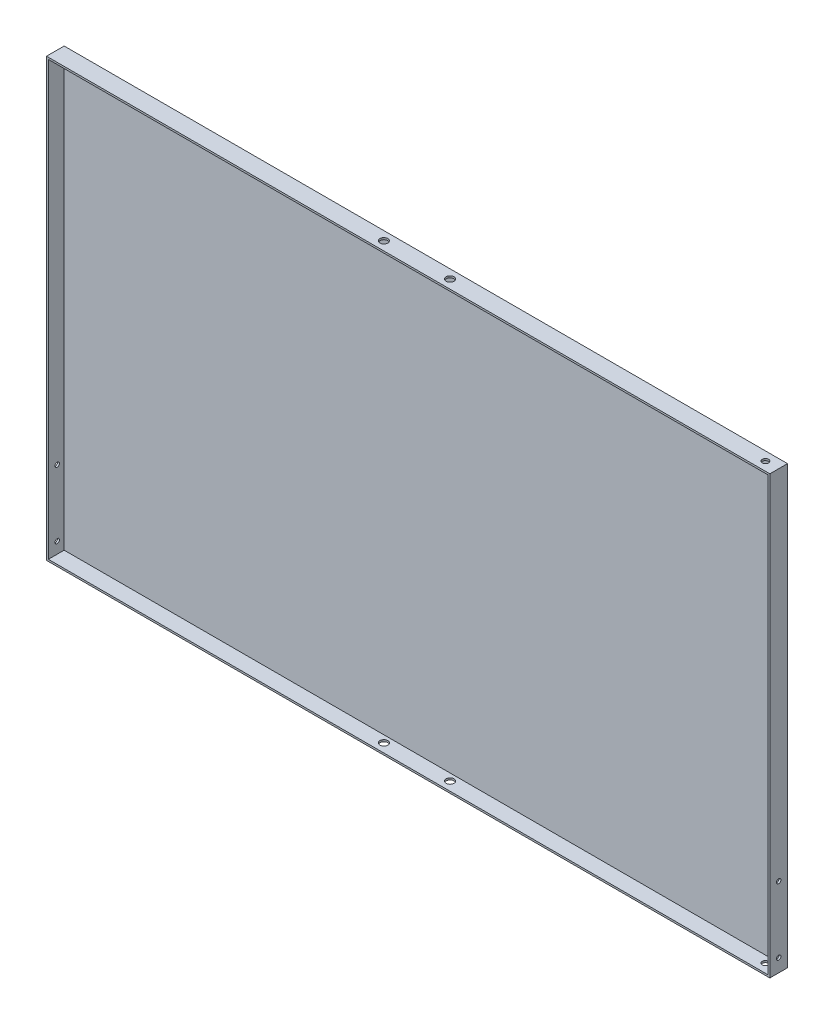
from build123d import *

# Parameters (mm, degrees)
ESQUISSE1_W                  = 1640
ESQUISSE1_H                  = 990
BOSS_EXTRU_1_DEPTH           = 40
COQUE1_T                     = -4.224360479
ESQUISSE2_R                  = 7.180212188
ESQUISSE2_R_2                = 8.952519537
ENL_V_MAT_EXTRU_1_DEPTH      = 1287.118190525
ENL_V_MAT_EXTRU_2_DEPTH      = 1714.541654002
ENL_V_MAT_EXTRU_2_DEPTH_BACK = 1714.541654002
ESQUISSE3_R                  = 5


with BuildPart() as part:
    # Esquisse1 → Boss.-Extru.1 (new body)
    with BuildSketch(Plane.XY):
        Rectangle(ESQUISSE1_W, ESQUISSE1_H)
    extrude(amount=BOSS_EXTRU_1_DEPTH)

    # Coque1
    coque1_openings = [part.faces().sort_by_distance(p)[0] for p in [
        (0, 0, 40),
    ]]
    offset(amount=COQUE1_T, openings=coque1_openings, kind=Kind.INTERSECTION)

    # Esquisse2 → Enl_v. mat.-Extru.1 (cut, through all)
    with BuildSketch(Plane(origin=(0, 495, 0), x_dir=(1, 0, 0), z_dir=(0, 1, 0))):
        with Locations(Location((790, -20, 0), (0, 0, 180))):
            Circle(ESQUISSE2_R)
        with Locations(Location((-75, -20, 0), (0, 0, 180))):
            Circle(ESQUISSE2_R_2)
        with Locations((75, -20)):
            Circle(ESQUISSE2_R_2)
    extrude(amount=-ENL_V_MAT_EXTRU_1_DEPTH, mode=Mode.SUBTRACT)

    # Esquisse3 → Enl_v. mat.-Extru.2 (cut, two sides: drawn at the far end of the back side and taken through both)
    with BuildSketch(Plane.ZY.offset(820).offset(-ENL_V_MAT_EXTRU_2_DEPTH_BACK)):
        with Locations((20, -465)):
            Circle(ESQUISSE3_R)
        with Locations((20, -315)):
            Circle(ESQUISSE3_R)
    extrude(amount=ENL_V_MAT_EXTRU_2_DEPTH + ENL_V_MAT_EXTRU_2_DEPTH_BACK, mode=Mode.SUBTRACT)


solid = part.part
